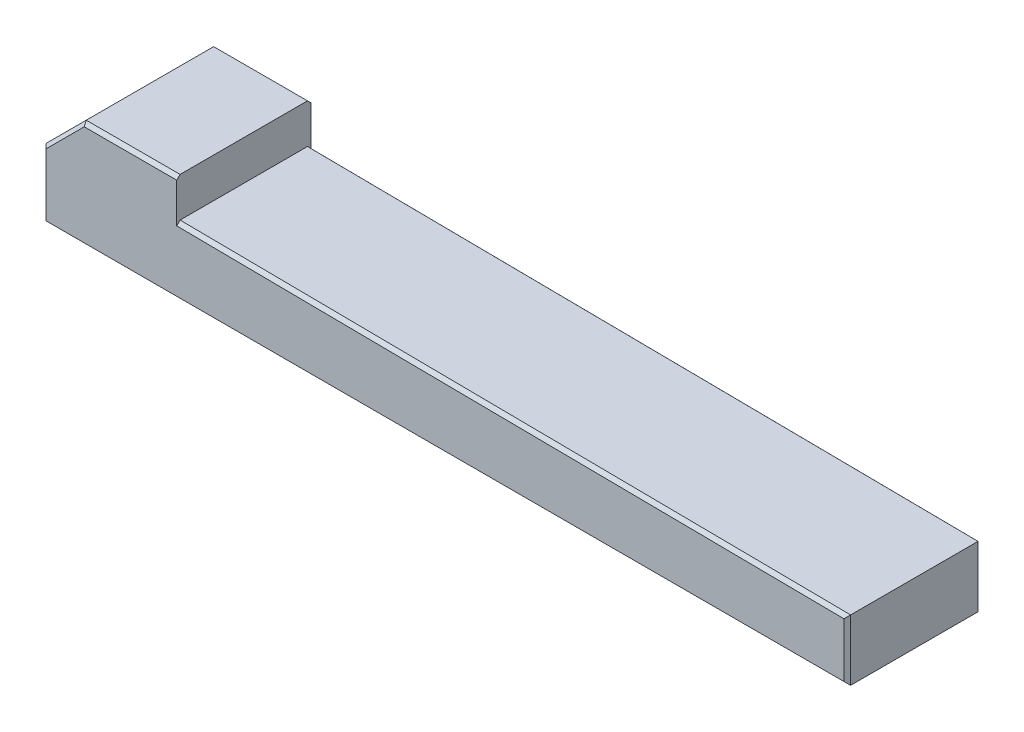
from build123d import *

# Parameters (mm, degrees)
BASEKEY_DEPTH = 50
CHAMFER1_SIZE = 2.5


with BuildPart() as part:
    # Sketch1 → BaseKey (new, symmetric)
    with BuildSketch(Plane.XY):
        Polygon((0, 0), (600, 0), (600, 45.499518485), (100, 50.500053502), (100, 80), (30, 80), (0, 50), align=None)
    extrude(amount=BASEKEY_DEPTH, both=True)

    # Chamfer1
    chamfer1_edges = [part.edges().sort_by_distance(p)[0] for p in [
        (600, 22.749759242, 50),
        (350, 47.999785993, 50),
        (65, 80, 50),
        (15, 65, 50),
        (0, 25, 50),
        (15, 65, -50),
        (300, 0, 50),
        (65, 80, -50),
        (350, 47.999785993, -50),
        (600, 22.749759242, -50),
        (300, 0, -50),
        (0, 25, -50),
    ]]
    chamfer(chamfer1_edges, length=CHAMFER1_SIZE)


solid = part.part
